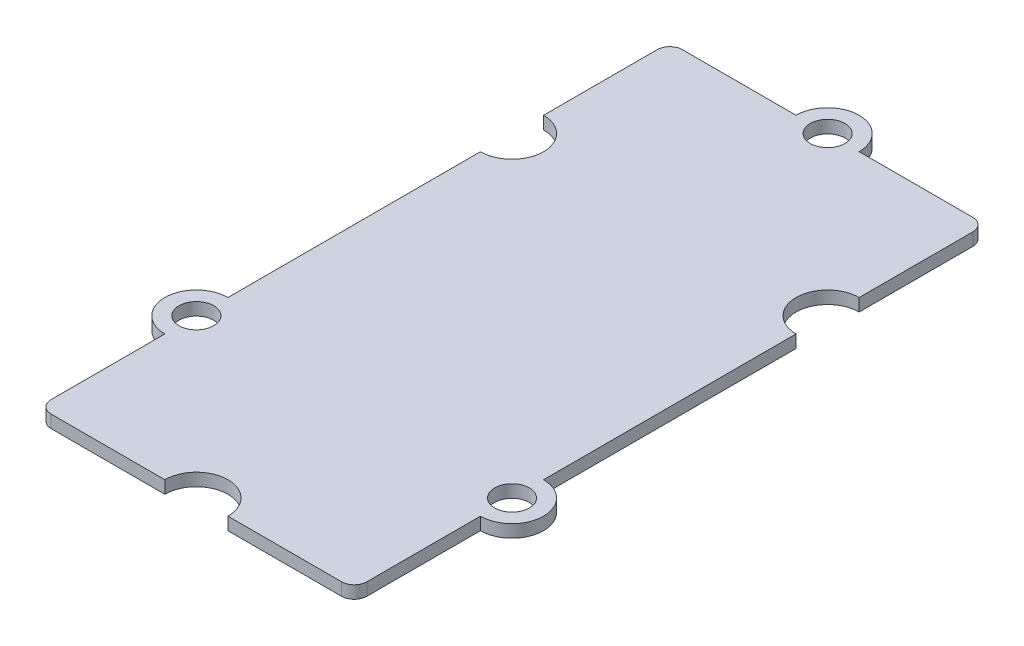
from build123d import *

# Parameters (mm, degrees)
SKETCH1_R   = 1.1
BOARD_DEPTH = 0.8


with BuildPart() as part:
    # Sketch1 → Board (new body)
    with BuildSketch(Plane(origin=(0, 0, 0), x_dir=(1, 0, 0), z_dir=(0, 1, 0))):
        with BuildLine():
            Line((0.8, 0), (8, 0))
            ThreePointArc((8, 0), (10, 2), (12, 0))
            Line((12, 0), (19.2, 0))
            ThreePointArc((19.2, 0), (19.765685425, 0.234314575), (20, 0.8))
            Line((20, 0.8), (20, 8))
            ThreePointArc((20, 8), (22, 10), (20, 12))
            Line((20, 12), (20, 28))
            ThreePointArc((20, 28), (18, 30), (20, 32))
            Line((20, 32), (20, 39.2))
            ThreePointArc((20, 39.2), (19.765685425, 39.765685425), (19.2, 40))
            Line((19.2, 40), (12, 40))
            ThreePointArc((12, 40), (10, 42), (8, 40))
            Line((8, 40), (0.8, 40))
            ThreePointArc((0.8, 40), (0.234314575, 39.765685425), (0, 39.2))
            Line((0, 39.2), (0, 32))
            ThreePointArc((0, 32), (2, 30), (0, 28))
            Line((0, 28), (0, 12))
            ThreePointArc((0, 12), (-2, 10), (0, 8))
            Line((0, 8), (0, 0.8))
            ThreePointArc((0, 0.8), (0.234314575, 0.234314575), (0.8, 0))
        make_face()
        with Locations(Location((10, 40, 0), (0, 0, 270))):
            Circle(SKETCH1_R, mode=Mode.SUBTRACT)
        with Locations(Location((0, 10, 0), (0, 0, 270))):
            Circle(SKETCH1_R, mode=Mode.SUBTRACT)
        with Locations(Location((20, 10, 0), (0, 0, 270))):
            Circle(SKETCH1_R, mode=Mode.SUBTRACT)
    extrude(amount=BOARD_DEPTH)


solid = part.part
